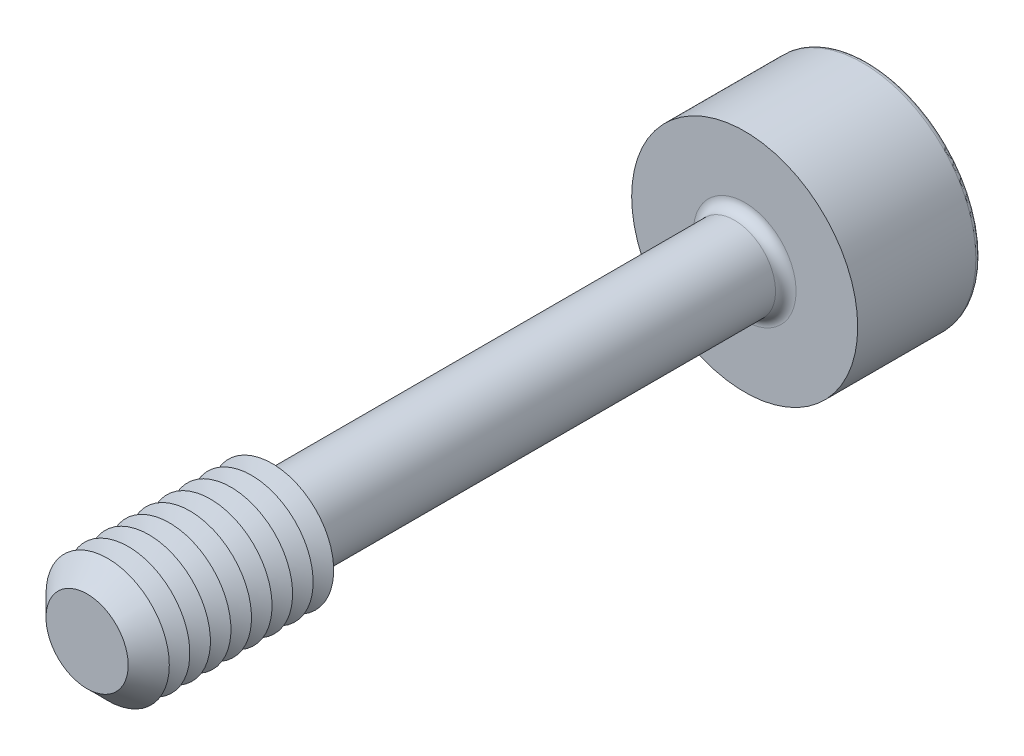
from build123d import *

# Parameters (mm, degrees)
SKETCH1_R       = 1
EXTRUDE1_DEPTH  = 8
CHAMFER1_SIZE   = 0.5
SKETCH3_R       = 2.75
EXTRUDE2_DEPTH  = 3
EXTRUDE3_DEPTH  = 2.5
FILLET1_R       = 0.25
FILLET2_R       = 0.125
LPATTERN1_COUNT = 8
LPATTERN1_PITCH = 0.5


with BuildPart() as part:
    # Sketch1 → Extrude1 (new, symmetric)
    with BuildSketch(Plane.XY):
        Circle(SKETCH1_R)
    extrude(amount=EXTRUDE1_DEPTH, both=True)

    # Sketch2 → Revolve1 (revolve)
    with BuildSketch(Plane(origin=(0, 0, 0), x_dir=(0, 0, -1), z_dir=(1, 0, 0))):
        Polygon((-8, 0), (-8, 1.5), (-3.5, 1.5), (-3.211324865, 1), (-3.211324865, 0), align=None)
    revolve(axis=Axis((0, 0, 3.211324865), (0, 0, 1)))

    # Chamfer1
    chamfer1_edges = [part.edges().sort_by_distance(p)[0] for p in [
        (0, -1.5, 8),
    ]]
    chamfer(chamfer1_edges, length=CHAMFER1_SIZE)

    # Sketch3 → Extrude2 (add)
    with BuildSketch(Plane(origin=(0, 0, -8), x_dir=(-1, 0, 0), z_dir=(0, 0, -1))):
        Circle(SKETCH3_R)
    extrude(amount=EXTRUDE2_DEPTH)

    # Sketch4 → Extrude3 (cut)
    with BuildSketch(Plane(origin=(-13.7, 0, -11), x_dir=(1, 0, 0), z_dir=(0, 0, 1))):
        Polygon((12.978312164, -1.25), (14.421687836, -1.25), (15.143375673, 0), (14.421687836, 1.25), (12.978312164, 1.25), (12.256624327, 0), align=None)
    extrude(amount=EXTRUDE3_DEPTH, mode=Mode.SUBTRACT)

    # Fillet1
    fillet1_edges = [part.edges().sort_by_distance(p)[0] for p in [
        (-1, 0, -8),
    ]]
    fillet(fillet1_edges, radius=FILLET1_R)

    # Fillet2
    fillet2_edges = [part.edges().sort_by_distance(p)[0] for p in [
        (2.75, 0, -11),
    ]]
    fillet(fillet2_edges, radius=FILLET2_R)

    # Sketch5 → Cut-Revolve1 (revolve, cut)
    with BuildSketch(Plane(origin=(0, 0, 0), x_dir=(0, 0, -1), z_dir=(1, 0, 0)), mode=Mode.PRIVATE) as cut_revolve1_sk:
        Polygon((8.5, 0), (8.5, -1.25), (7.778312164, 0), align=None)
    revolve(cut_revolve1_sk.sketch.rotate(Axis((0, 0, -7.778312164), (0, 0, -1)), 90), axis=Axis((0, 0, -7.778312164), (0, 0, -1)), mode=Mode.SUBTRACT)

    # Sketch7 → Cut-Revolve2 (revolve, cut)
    with BuildSketch(Plane(origin=(0, 0, 0), x_dir=(0, 0, -1), z_dir=(1, 0, 0)), mode=Mode.PRIVATE) as cut_revolve2_sk:
        Polygon((-3.5, 1.5), (-3.75, 1.066987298), (-4, 1.5), align=None)
    cut_revolve2 = revolve(cut_revolve2_sk.sketch.rotate(Axis((0, 0, -1.332048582), (0, 0, 1)), 90), axis=Axis((0, 0, -1.332048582), (0, 0, 1)), mode=Mode.SUBTRACT)

    # LPattern1: Cut-Revolve2 ×8
    with Locations(*[(0, 0, i * LPATTERN1_PITCH) for i in range(1, LPATTERN1_COUNT)]):
        add(cut_revolve2, mode=Mode.SUBTRACT)


solid = part.part
